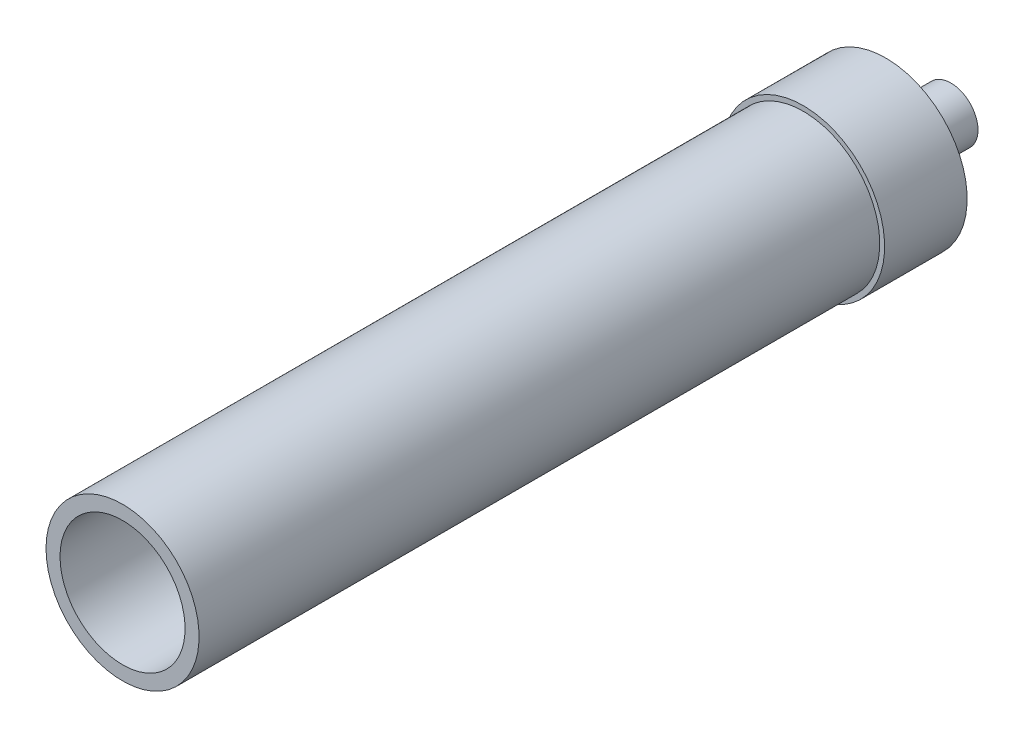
from build123d import *

# Parameters (mm, degrees)
SKETCH1_R      = 8.9535
SKETCH1_R_2    = 7.3152
EXTRUDE1_DEPTH = 89.281
SKETCH2_R      = 9.525
EXTRUDE2_DEPTH = 9.652
SKETCH3_R      = 3.175
EXTRUDE3_DEPTH = 7.62
SKETCH4_R      = 4.445
EXTRUDE4_DEPTH = 1.27


with BuildPart() as part:
    # Sketch1 → Extrude1 (new body)
    with BuildSketch(Plane.XY):
        with Locations(Location((0, 0, 0), (0, 0, 180))):
            Circle(SKETCH1_R)
        with Locations(Location((0, 0, 0), (0, 0, 180))):
            Circle(SKETCH1_R_2, mode=Mode.SUBTRACT)
    extrude(amount=EXTRUDE1_DEPTH)

    # Sketch2 → Extrude2 (add)
    with BuildSketch(Plane.XY):
        with Locations(Location((0, 0, 0), (0, 0, 180))):
            Circle(SKETCH2_R)
    extrude(amount=EXTRUDE2_DEPTH)

    # Sketch3 → Extrude3 (add)
    with BuildSketch(Plane(origin=(0, 0, 0), x_dir=(-1, 0, 0), z_dir=(0, 0, -1))):
        with Locations(Location((0, 0, 0), (0, 0, 180))):
            Circle(SKETCH3_R)
    extrude(amount=EXTRUDE3_DEPTH)

    # Sketch4 → Extrude4 (add)
    with BuildSketch(Plane(origin=(0, 0, 0), x_dir=(-1, 0, 0), z_dir=(0, 0, -1))):
        with Locations(Location((0, 0, 0), (0, 0, 180))):
            Circle(SKETCH4_R)
    extrude(amount=EXTRUDE4_DEPTH)


solid = part.part
